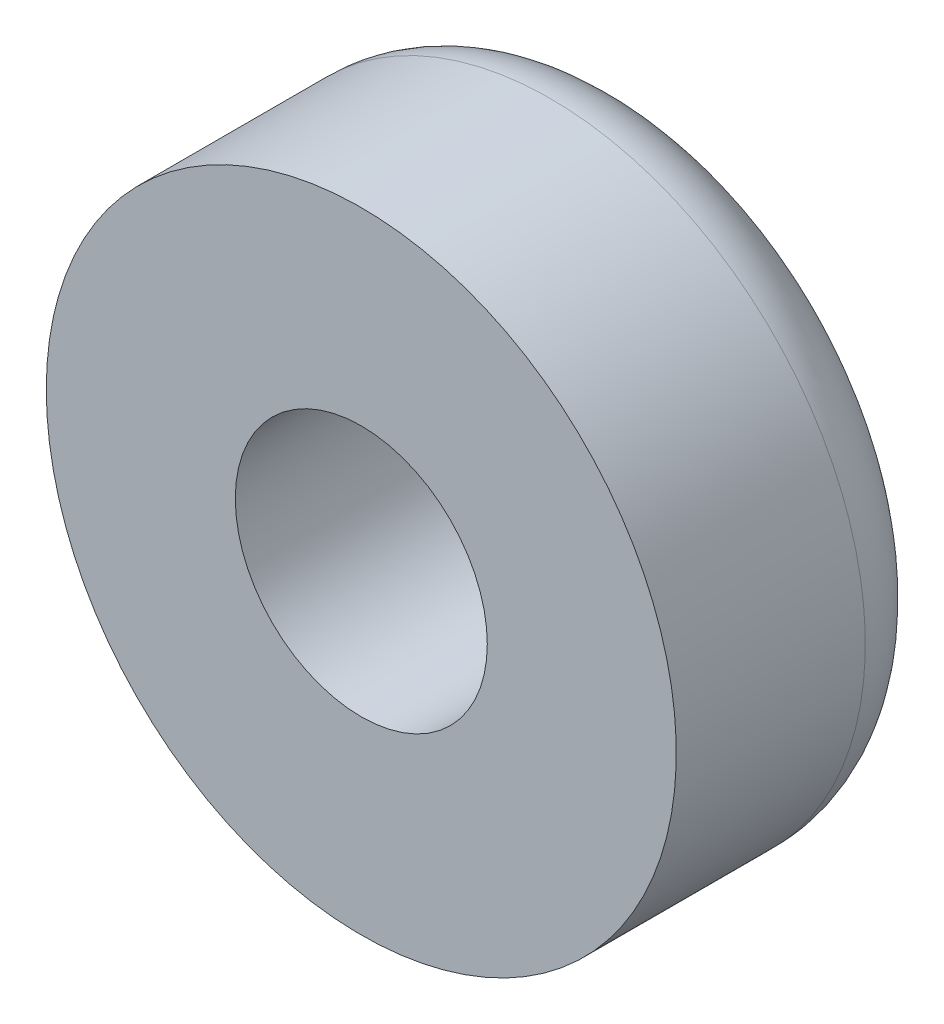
ISO-10303-21;
HEADER;
FILE_DESCRIPTION(('STEP AP214'),'2;1');
FILE_NAME('part.step','',(''),(''),'','','');
FILE_SCHEMA(('AUTOMOTIVE_DESIGN { 1 0 10303 214 1 1 1 1 }'));
ENDSEC;
DATA;
#1=APPLICATION_CONTEXT('core data for automotive mechanical design processes');
#2=APPLICATION_PROTOCOL_DEFINITION('international standard','automotive_design',2000,#1);
#3=PRODUCT_CONTEXT('',#1,'mechanical');
#4=PRODUCT('Part','Part','',(#3));
#5=PRODUCT_RELATED_PRODUCT_CATEGORY('part','',(#4));
#6=PRODUCT_DEFINITION_FORMATION('','',#4);
#7=PRODUCT_DEFINITION_CONTEXT('part definition',#1,'design');
#8=PRODUCT_DEFINITION('design','',#6,#7);
#9=PRODUCT_DEFINITION_SHAPE('','',#8);
#10=(LENGTH_UNIT() NAMED_UNIT(*) SI_UNIT(.MILLI.,.METRE.));
#11=(NAMED_UNIT(*) PLANE_ANGLE_UNIT() SI_UNIT($,.RADIAN.));
#12=(NAMED_UNIT(*) SI_UNIT($,.STERADIAN.) SOLID_ANGLE_UNIT());
#13=UNCERTAINTY_MEASURE_WITH_UNIT(LENGTH_MEASURE(1.E-05),#10,'distance_accuracy_value','');
#14=(GEOMETRIC_REPRESENTATION_CONTEXT(3) GLOBAL_UNCERTAINTY_ASSIGNED_CONTEXT((#13)) GLOBAL_UNIT_ASSIGNED_CONTEXT((#10,
#11,#12)) REPRESENTATION_CONTEXT('',''));
#15=CARTESIAN_POINT('',(0.,0.,0.));
#16=DIRECTION('',(0.,0.,1.));
#17=DIRECTION('',(1.,0.,0.));
#18=AXIS2_PLACEMENT_3D('',#15,#16,#17);
#19=CARTESIAN_POINT('',(-4.5312519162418,29.374999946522,-319.));
#20=DIRECTION('',(0.,0.,1.));
#21=DIRECTION('',(1.,0.,0.));
#22=AXIS2_PLACEMENT_3D('',#19,#20,#21);
#23=CYLINDRICAL_SURFACE('',#22,20.);
#24=CARTESIAN_POINT('',(-4.5312519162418,29.374999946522,-314.));
#25=DIRECTION('',(0.,0.,-1.));
#26=DIRECTION('',(-1.,0.,0.));
#27=AXIS2_PLACEMENT_3D('',#24,#25,#26);
#28=CIRCLE('',#27,20.);
#29=CARTESIAN_POINT('',(-24.5312519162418,29.374999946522,-314.));
#30=VERTEX_POINT('',#29);
#31=EDGE_CURVE('E10',#30,#30,#28,.F.);
#32=ORIENTED_EDGE('',*,*,#31,.T.);
#33=EDGE_LOOP('',(#32));
#34=FACE_BOUND('',#33,.T.);
#35=CARTESIAN_POINT('',(-4.5312519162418,29.374999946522,-302.));
#36=DIRECTION('',(0.,0.,-1.));
#37=DIRECTION('',(-1.,0.,0.));
#38=AXIS2_PLACEMENT_3D('',#35,#36,#37);
#39=CIRCLE('',#38,20.);
#40=CARTESIAN_POINT('',(-24.5312519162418,29.374999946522,-302.));
#41=VERTEX_POINT('',#40);
#42=EDGE_CURVE('E357',#41,#41,#39,.T.);
#43=ORIENTED_EDGE('',*,*,#42,.T.);
#44=EDGE_LOOP('',(#43));
#45=FACE_BOUND('',#44,.T.);
#46=ADVANCED_FACE('F346',(#34,#45),#23,.T.);
#47=CARTESIAN_POINT('',(-4.5312519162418,29.374999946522,-319.));
#48=DIRECTION('',(0.,0.,-1.));
#49=DIRECTION('',(-1.,0.,0.));
#50=AXIS2_PLACEMENT_3D('',#47,#48,#49);
#51=PLANE('',#50);
#52=CARTESIAN_POINT('',(-4.5312519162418,29.374999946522,-319.));
#53=DIRECTION('',(0.,0.,-1.));
#54=DIRECTION('',(-1.,0.,0.));
#55=AXIS2_PLACEMENT_3D('',#52,#53,#54);
#56=CIRCLE('',#55,8.);
#57=CARTESIAN_POINT('',(-12.5312519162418,29.374999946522,-319.));
#58=VERTEX_POINT('',#57);
#59=EDGE_CURVE('E362',#58,#58,#56,.T.);
#60=ORIENTED_EDGE('',*,*,#59,.F.);
#61=EDGE_LOOP('',(#60));
#62=FACE_BOUND('',#61,.T.);
#63=CARTESIAN_POINT('',(-4.5312519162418,29.374999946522,-319.));
#64=DIRECTION('',(0.,0.,-1.));
#65=DIRECTION('',(-1.,0.,0.));
#66=AXIS2_PLACEMENT_3D('',#63,#64,#65);
#67=CIRCLE('',#66,15.);
#68=CARTESIAN_POINT('',(-19.5312519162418,29.374999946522,-319.));
#69=VERTEX_POINT('',#68);
#70=EDGE_CURVE('E353',#69,#69,#67,.T.);
#71=ORIENTED_EDGE('',*,*,#70,.T.);
#72=EDGE_LOOP('',(#71));
#73=FACE_BOUND('',#72,.T.);
#74=ADVANCED_FACE('F383',(#62,#73),#51,.T.);
#75=CARTESIAN_POINT('',(-4.5312519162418,29.374999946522,-302.));
#76=DIRECTION('',(0.,0.,-1.));
#77=DIRECTION('',(-1.,0.,0.));
#78=AXIS2_PLACEMENT_3D('',#75,#76,#77);
#79=PLANE('',#78);
#80=CARTESIAN_POINT('',(-4.5312519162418,29.374999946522,-302.));
#81=DIRECTION('',(0.,0.,-1.));
#82=DIRECTION('',(-1.,0.,0.));
#83=AXIS2_PLACEMENT_3D('',#80,#81,#82);
#84=CIRCLE('',#83,8.);
#85=CARTESIAN_POINT('',(-12.5312519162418,29.374999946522,-302.));
#86=VERTEX_POINT('',#85);
#87=EDGE_CURVE('E349',#86,#86,#84,.T.);
#88=ORIENTED_EDGE('',*,*,#87,.T.);
#89=EDGE_LOOP('',(#88));
#90=FACE_BOUND('',#89,.T.);
#91=ORIENTED_EDGE('',*,*,#42,.F.);
#92=EDGE_LOOP('',(#91));
#93=FACE_BOUND('',#92,.T.);
#94=ADVANCED_FACE('F369',(#90,#93),#79,.F.);
#95=CARTESIAN_POINT('',(-4.5312519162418,29.374999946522,-314.));
#96=DIRECTION('',(0.,0.,-1.));
#97=DIRECTION('',(-1.,0.,0.));
#98=AXIS2_PLACEMENT_3D('',#95,#96,#97);
#99=TOROIDAL_SURFACE('',#98,15.,5.);
#100=ORIENTED_EDGE('',*,*,#31,.F.);
#101=EDGE_LOOP('',(#100));
#102=FACE_BOUND('',#101,.T.);
#103=ORIENTED_EDGE('',*,*,#70,.F.);
#104=EDGE_LOOP('',(#103));
#105=FACE_BOUND('',#104,.T.);
#106=ADVANCED_FACE('F374',(#102,#105),#99,.T.);
#107=CARTESIAN_POINT('',(-4.5312519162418,29.374999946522,-289.));
#108=DIRECTION('',(0.,0.,-1.));
#109=DIRECTION('',(-1.,0.,0.));
#110=AXIS2_PLACEMENT_3D('',#107,#108,#109);
#111=CYLINDRICAL_SURFACE('',#110,8.);
#112=ORIENTED_EDGE('',*,*,#59,.T.);
#113=EDGE_LOOP('',(#112));
#114=FACE_BOUND('',#113,.T.);
#115=ORIENTED_EDGE('',*,*,#87,.F.);
#116=EDGE_LOOP('',(#115));
#117=FACE_BOUND('',#116,.T.);
#118=ADVANCED_FACE('F372',(#114,#117),#111,.F.);
#119=CLOSED_SHELL('',(#46,#74,#94,#106,#118));
#120=MANIFOLD_SOLID_BREP('B2',#119);
#121=ADVANCED_BREP_SHAPE_REPRESENTATION('',(#18,#120),#14);
#122=SHAPE_DEFINITION_REPRESENTATION(#9,#121);
ENDSEC;
END-ISO-10303-21;
